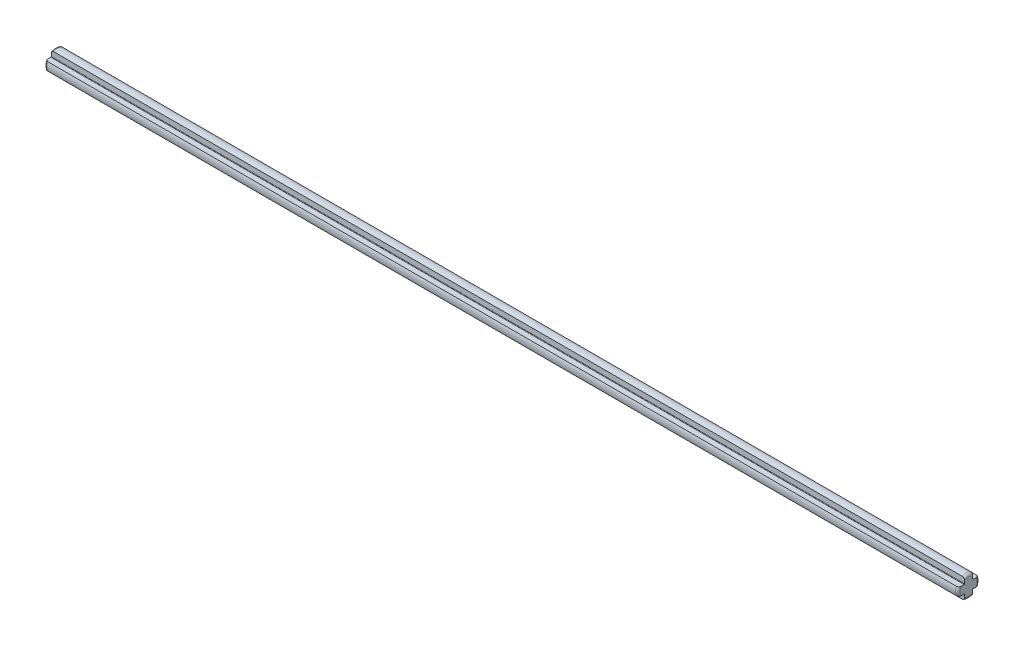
from build123d import *

# Parameters (mm, degrees)
EXTRUIR1_DEPTH = 100
REDONDEO1_R    = 0.5


with BuildPart() as part:
    # Croquis1 → Extruir1 (new, symmetric)
    with BuildSketch(Plane(origin=(0, 0, 0), x_dir=(0, 0, -1), z_dir=(1, 0, 0))):
        with BuildLine():
            Line((-0.9, 2.170829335), (-0.9, 1))
            ThreePointArc((-0.9, 1), (-0.929289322, 0.929289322), (-1, 0.9))
            Line((-1, 0.9), (-2.170829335, 0.9))
            ThreePointArc((-2.170829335, 0.9), (-2.35, 0), (-2.170829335, -0.9))
            Line((-2.170829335, -0.9), (-1, -0.9))
            ThreePointArc((-1, -0.9), (-0.929289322, -0.929289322), (-0.9, -1))
            Line((-0.9, -1), (-0.9, -2.170829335))
            ThreePointArc((-0.9, -2.170829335), (0, -2.35), (0.9, -2.170829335))
            Line((0.9, -2.170829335), (0.9, -1))
            ThreePointArc((0.9, -1), (0.929289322, -0.929289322), (1, -0.9))
            Line((1, -0.9), (2.170829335, -0.9))
            ThreePointArc((2.170829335, -0.9), (2.35, 0), (2.170829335, 0.9))
            Line((2.170829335, 0.9), (1, 0.9))
            ThreePointArc((1, 0.9), (0.929289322, 0.929289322), (0.9, 1))
            Line((0.9, 1), (0.9, 2.170829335))
            ThreePointArc((0.9, 2.170829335), (0, 2.35), (-0.9, 2.170829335))
        make_face()
    extrude(amount=EXTRUIR1_DEPTH, both=True)

    # Redondeo1
    redondeo1_edges = [part.edges().sort_by_distance(p)[0] for p in [
        (-100, 2.35, 0),
        (100, -2.35, 0),
        (-100, 0, -2.35),
        (-100, -2.35, 0),
        (-100, 0, 2.35),
        (100, 0, -2.35),
        (100, 0, 2.35),
        (100, 2.35, 0),
    ]]
    fillet(redondeo1_edges, radius=REDONDEO1_R)


solid = part.part
